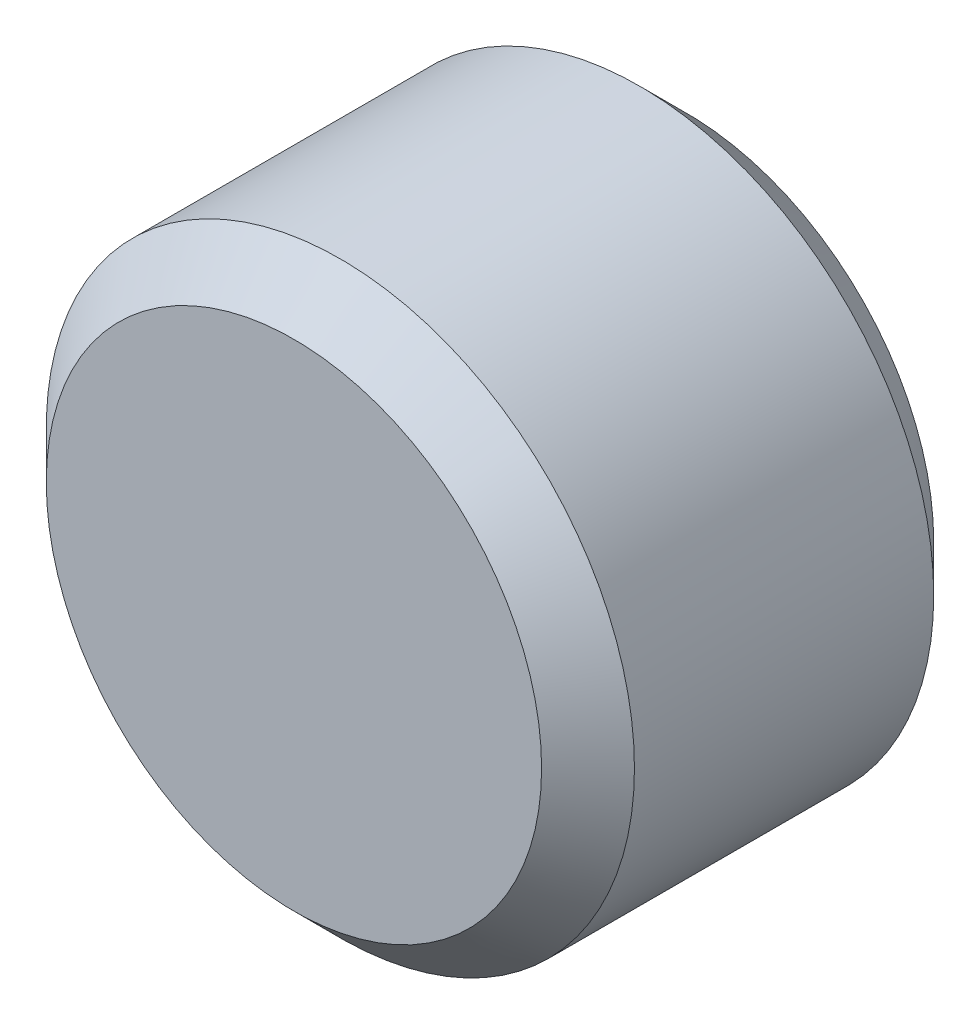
ISO-10303-21;
HEADER;
FILE_DESCRIPTION(('STEP AP214'),'2;1');
FILE_NAME('part.step','',(''),(''),'','','');
FILE_SCHEMA(('AUTOMOTIVE_DESIGN { 1 0 10303 214 1 1 1 1 }'));
ENDSEC;
DATA;
#1=APPLICATION_CONTEXT('core data for automotive mechanical design processes');
#2=APPLICATION_PROTOCOL_DEFINITION('international standard','automotive_design',2000,#1);
#3=PRODUCT_CONTEXT('',#1,'mechanical');
#4=PRODUCT('Part','Part','',(#3));
#5=PRODUCT_RELATED_PRODUCT_CATEGORY('part','',(#4));
#6=PRODUCT_DEFINITION_FORMATION('','',#4);
#7=PRODUCT_DEFINITION_CONTEXT('part definition',#1,'design');
#8=PRODUCT_DEFINITION('design','',#6,#7);
#9=PRODUCT_DEFINITION_SHAPE('','',#8);
#10=(LENGTH_UNIT() NAMED_UNIT(*) SI_UNIT(.MILLI.,.METRE.));
#11=(NAMED_UNIT(*) PLANE_ANGLE_UNIT() SI_UNIT($,.RADIAN.));
#12=(NAMED_UNIT(*) SI_UNIT($,.STERADIAN.) SOLID_ANGLE_UNIT());
#13=UNCERTAINTY_MEASURE_WITH_UNIT(LENGTH_MEASURE(1.E-05),#10,'distance_accuracy_value','');
#14=(GEOMETRIC_REPRESENTATION_CONTEXT(3) GLOBAL_UNCERTAINTY_ASSIGNED_CONTEXT((#13)) GLOBAL_UNIT_ASSIGNED_CONTEXT((#10,
#11,#12)) REPRESENTATION_CONTEXT('',''));
#15=CARTESIAN_POINT('',(0.,0.,0.));
#16=DIRECTION('',(0.,0.,1.));
#17=DIRECTION('',(1.,0.,0.));
#18=AXIS2_PLACEMENT_3D('',#15,#16,#17);
#19=CARTESIAN_POINT('',(0.,0.,8.00000000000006));
#20=DIRECTION('',(0.,0.,-1.00000000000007));
#21=DIRECTION('',(-1.00000000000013,0.,0.));
#22=AXIS2_PLACEMENT_3D('',#19,#20,#21);
#23=CYLINDRICAL_SURFACE('',#22,6.);
#24=CARTESIAN_POINT('',(-6.38378239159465E-13,2.22044604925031E-13,7.05281250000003));
#25=DIRECTION('',(0.,0.,1.00000000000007));
#26=DIRECTION('',(1.00000000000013,0.,0.));
#27=AXIS2_PLACEMENT_3D('',#24,#25,#26);
#28=CIRCLE('',#27,6.);
#29=CARTESIAN_POINT('',(6.00000000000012,2.28729278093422E-13,7.05281250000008));
#30=VERTEX_POINT('',#29);
#31=EDGE_CURVE('E50',#30,#30,#28,.F.);
#32=ORIENTED_EDGE('',*,*,#31,.T.);
#33=EDGE_LOOP('',(#32));
#34=FACE_BOUND('',#33,.T.);
#35=CARTESIAN_POINT('',(-7.49400541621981E-13,-1.11022302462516E-13,0.947187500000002));
#36=DIRECTION('',(0.,0.,1.00000000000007));
#37=DIRECTION('',(1.00000000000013,0.,0.));
#38=AXIS2_PLACEMENT_3D('',#35,#36,#37);
#39=CIRCLE('',#38,6.);
#40=CARTESIAN_POINT('',(6.00000000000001,-1.04337629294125E-13,0.947187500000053));
#41=VERTEX_POINT('',#40);
#42=EDGE_CURVE('E188',#41,#41,#39,.T.);
#43=ORIENTED_EDGE('',*,*,#42,.T.);
#44=EDGE_LOOP('',(#43));
#45=FACE_BOUND('',#44,.T.);
#46=ADVANCED_FACE('F43',(#34,#45),#23,.T.);
#47=CARTESIAN_POINT('',(0.,0.,8.00000000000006));
#48=DIRECTION('',(0.,0.,1.00000000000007));
#49=DIRECTION('',(1.00000000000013,0.,0.));
#50=AXIS2_PLACEMENT_3D('',#47,#48,#49);
#51=PLANE('',#50);
#52=CARTESIAN_POINT('',(0.,0.,8.00000000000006));
#53=DIRECTION('',(0.,0.,1.00000000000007));
#54=DIRECTION('',(1.00000000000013,0.,0.));
#55=AXIS2_PLACEMENT_3D('',#52,#53,#54);
#56=CIRCLE('',#55,5.05281249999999);
#57=CARTESIAN_POINT('',(5.05281250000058,0.,8.00000000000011));
#58=VERTEX_POINT('',#57);
#59=EDGE_CURVE('E184',#58,#58,#56,.T.);
#60=ORIENTED_EDGE('',*,*,#59,.T.);
#61=EDGE_LOOP('',(#60));
#62=FACE_BOUND('',#61,.T.);
#63=ADVANCED_FACE('F202',(#62),#51,.T.);
#64=CARTESIAN_POINT('',(0.,0.,0.));
#65=DIRECTION('',(0.,0.,1.00000000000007));
#66=DIRECTION('',(1.00000000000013,0.,0.));
#67=AXIS2_PLACEMENT_3D('',#64,#65,#66);
#68=PLANE('',#67);
#69=DIRECTION('',(-0.500000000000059,-0.866025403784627,0.));
#70=VECTOR('',#69,1.);
#71=CARTESIAN_POINT('',(1.73205080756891,-3.,0.));
#72=LINE('',#71,#70);
#73=CARTESIAN_POINT('',(3.46410161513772,0.,2.16493489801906E-12));
#74=VERTEX_POINT('',#73);
#75=CARTESIAN_POINT('',(1.73205080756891,-3.,0.));
#76=VERTEX_POINT('',#75);
#77=EDGE_CURVE('E118',#74,#76,#72,.T.);
#78=ORIENTED_EDGE('',*,*,#77,.F.);
#79=DIRECTION('',(0.500000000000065,-0.866025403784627,0.));
#80=VECTOR('',#79,1.);
#81=CARTESIAN_POINT('',(3.46410161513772,0.,2.16493489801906E-12));
#82=LINE('',#81,#80);
#83=CARTESIAN_POINT('',(1.73205080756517,2.99999999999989,0.));
#84=VERTEX_POINT('',#83);
#85=EDGE_CURVE('E57',#84,#74,#82,.T.);
#86=ORIENTED_EDGE('',*,*,#85,.F.);
#87=DIRECTION('',(1.00000000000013,0.,0.));
#88=VECTOR('',#87,1.);
#89=CARTESIAN_POINT('',(1.73205080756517,2.99999999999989,0.));
#90=LINE('',#89,#88);
#91=CARTESIAN_POINT('',(-1.7320508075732,2.99999999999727,0.));
#92=VERTEX_POINT('',#91);
#93=EDGE_CURVE('E148',#92,#84,#90,.T.);
#94=ORIENTED_EDGE('',*,*,#93,.F.);
#95=DIRECTION('',(0.500000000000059,0.866025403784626,0.));
#96=VECTOR('',#95,1.);
#97=CARTESIAN_POINT('',(-1.7320508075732,2.99999999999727,0.));
#98=LINE('',#97,#96);
#99=CARTESIAN_POINT('',(-3.46410161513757,-2.90045765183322E-12,0.));
#100=VERTEX_POINT('',#99);
#101=EDGE_CURVE('E143',#100,#92,#98,.T.);
#102=ORIENTED_EDGE('',*,*,#101,.F.);
#103=DIRECTION('',(-0.500000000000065,0.866025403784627,0.));
#104=VECTOR('',#103,1.);
#105=CARTESIAN_POINT('',(-3.46410161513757,-2.90045765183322E-12,0.));
#106=LINE('',#105,#104);
#107=CARTESIAN_POINT('',(-1.73205080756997,-3.00000000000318,0.));
#108=VERTEX_POINT('',#107);
#109=EDGE_CURVE('E141',#108,#100,#106,.T.);
#110=ORIENTED_EDGE('',*,*,#109,.F.);
#111=DIRECTION('',(-1.00000000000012,0.,0.));
#112=VECTOR('',#111,1.);
#113=CARTESIAN_POINT('',(-1.73205080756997,-3.00000000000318,0.));
#114=LINE('',#113,#112);
#115=EDGE_CURVE('E126',#76,#108,#114,.T.);
#116=ORIENTED_EDGE('',*,*,#115,.F.);
#117=EDGE_LOOP('',(#78,#86,#94,#102,#110,#116));
#118=FACE_BOUND('',#117,.T.);
#119=CARTESIAN_POINT('',(0.,0.,0.));
#120=DIRECTION('',(0.,0.,1.00000000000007));
#121=DIRECTION('',(1.00000000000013,0.,0.));
#122=AXIS2_PLACEMENT_3D('',#119,#120,#121);
#123=CIRCLE('',#122,5.05281249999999);
#124=CARTESIAN_POINT('',(5.05281250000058,0.,0.));
#125=VERTEX_POINT('',#124);
#126=EDGE_CURVE('E13',#125,#125,#123,.F.);
#127=ORIENTED_EDGE('',*,*,#126,.T.);
#128=EDGE_LOOP('',(#127));
#129=FACE_BOUND('',#128,.T.);
#130=ADVANCED_FACE('F138',(#118,#129),#68,.F.);
#131=CARTESIAN_POINT('',(0.,0.,8.00000000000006));
#132=DIRECTION('',(0.,0.,-1.00000000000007));
#133=DIRECTION('',(-1.00000000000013,0.,0.));
#134=AXIS2_PLACEMENT_3D('',#131,#132,#133);
#135=CONICAL_SURFACE('',#134,5.05281249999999,0.785398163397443);
#136=ORIENTED_EDGE('',*,*,#31,.F.);
#137=EDGE_LOOP('',(#136));
#138=FACE_BOUND('',#137,.T.);
#139=ORIENTED_EDGE('',*,*,#59,.F.);
#140=EDGE_LOOP('',(#139));
#141=FACE_BOUND('',#140,.T.);
#142=ADVANCED_FACE('F195',(#138,#141),#135,.T.);
#143=CARTESIAN_POINT('',(-7.49400541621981E-13,-1.11022302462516E-13,0.947187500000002));
#144=DIRECTION('',(0.,0.,1.00000000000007));
#145=DIRECTION('',(1.00000000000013,0.,0.));
#146=AXIS2_PLACEMENT_3D('',#143,#144,#145);
#147=CONICAL_SURFACE('',#146,6.,0.785398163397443);
#148=ORIENTED_EDGE('',*,*,#126,.F.);
#149=EDGE_LOOP('',(#148));
#150=FACE_BOUND('',#149,.T.);
#151=ORIENTED_EDGE('',*,*,#42,.F.);
#152=EDGE_LOOP('',(#151));
#153=FACE_BOUND('',#152,.T.);
#154=ADVANCED_FACE('F198',(#150,#153),#147,.T.);
#155=CARTESIAN_POINT('',(3.4641016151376,0.,4.80000000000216));
#156=DIRECTION('',(0.866025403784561,0.500000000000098,0.));
#157=DIRECTION('',(-0.500000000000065,0.866025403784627,0.));
#158=AXIS2_PLACEMENT_3D('',#155,#156,#157);
#159=PLANE('',#158);
#160=ORIENTED_EDGE('',*,*,#85,.T.);
#161=DIRECTION('',(0.,0.,-1.00000000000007));
#162=VECTOR('',#161,1.);
#163=CARTESIAN_POINT('',(3.4641016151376,0.,4.80000000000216));
#164=LINE('',#163,#162);
#165=CARTESIAN_POINT('',(3.4641016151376,0.,4.80000000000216));
#166=VERTEX_POINT('',#165);
#167=EDGE_CURVE('E123',#166,#74,#164,.T.);
#168=ORIENTED_EDGE('',*,*,#167,.F.);
#169=DIRECTION('',(0.500000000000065,-0.866025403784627,0.));
#170=VECTOR('',#169,1.);
#171=CARTESIAN_POINT('',(3.4641016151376,0.,4.80000000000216));
#172=LINE('',#171,#170);
#173=CARTESIAN_POINT('',(2.59807621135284,1.50000000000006,4.8));
#174=VERTEX_POINT('',#173);
#175=EDGE_CURVE('E150',#174,#166,#172,.T.);
#176=ORIENTED_EDGE('',*,*,#175,.F.);
#177=CARTESIAN_POINT('',(1.73205080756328,3.00000000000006,4.8));
#178=VERTEX_POINT('',#177);
#179=EDGE_CURVE('E151',#178,#174,#172,.T.);
#180=ORIENTED_EDGE('',*,*,#179,.F.);
#181=DIRECTION('',(0.,0.,-1.00000000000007));
#182=VECTOR('',#181,1.);
#183=CARTESIAN_POINT('',(1.73205080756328,3.00000000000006,4.8));
#184=LINE('',#183,#182);
#185=EDGE_CURVE('E170',#178,#84,#184,.T.);
#186=ORIENTED_EDGE('',*,*,#185,.T.);
#187=EDGE_LOOP('',(#160,#168,#176,#180,#186));
#188=FACE_BOUND('',#187,.T.);
#189=ADVANCED_FACE('F212',(#188),#159,.F.);
#190=CARTESIAN_POINT('',(1.73205080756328,3.00000000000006,4.8));
#191=DIRECTION('',(0.,1.00000000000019,0.));
#192=DIRECTION('',(0.,0.,1.00000000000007));
#193=AXIS2_PLACEMENT_3D('',#190,#191,#192);
#194=PLANE('',#193);
#195=ORIENTED_EDGE('',*,*,#93,.T.);
#196=ORIENTED_EDGE('',*,*,#185,.F.);
#197=DIRECTION('',(1.00000000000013,0.,0.));
#198=VECTOR('',#197,1.);
#199=CARTESIAN_POINT('',(1.73205080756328,3.00000000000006,4.8));
#200=LINE('',#199,#198);
#201=CARTESIAN_POINT('',(-5.82867087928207E-12,3.00000000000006,4.8));
#202=VERTEX_POINT('',#201);
#203=EDGE_CURVE('E166',#202,#178,#200,.T.);
#204=ORIENTED_EDGE('',*,*,#203,.F.);
#205=CARTESIAN_POINT('',(-1.73205080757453,2.99999999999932,4.8));
#206=VERTEX_POINT('',#205);
#207=EDGE_CURVE('E167',#206,#202,#200,.T.);
#208=ORIENTED_EDGE('',*,*,#207,.F.);
#209=DIRECTION('',(0.,0.,-1.00000000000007));
#210=VECTOR('',#209,1.);
#211=CARTESIAN_POINT('',(-1.73205080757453,2.99999999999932,4.8));
#212=LINE('',#211,#210);
#213=EDGE_CURVE('E173',#206,#92,#212,.T.);
#214=ORIENTED_EDGE('',*,*,#213,.T.);
#215=EDGE_LOOP('',(#195,#196,#204,#208,#214));
#216=FACE_BOUND('',#215,.T.);
#217=ADVANCED_FACE('F221',(#216),#194,.F.);
#218=CARTESIAN_POINT('',(-1.73205080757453,2.99999999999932,4.8));
#219=DIRECTION('',(-0.866025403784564,0.500000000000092,0.));
#220=DIRECTION('',(-0.50000000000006,-0.866025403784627,0.));
#221=AXIS2_PLACEMENT_3D('',#218,#219,#220);
#222=PLANE('',#221);
#223=ORIENTED_EDGE('',*,*,#101,.T.);
#224=ORIENTED_EDGE('',*,*,#213,.F.);
#225=DIRECTION('',(0.500000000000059,0.866025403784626,0.));
#226=VECTOR('',#225,1.);
#227=CARTESIAN_POINT('',(-1.73205080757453,2.99999999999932,4.8));
#228=LINE('',#227,#226);
#229=CARTESIAN_POINT('',(-2.59807621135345,1.49999999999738,4.80000000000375));
#230=VERTEX_POINT('',#229);
#231=EDGE_CURVE('E162',#230,#206,#228,.T.);
#232=ORIENTED_EDGE('',*,*,#231,.F.);
#233=CARTESIAN_POINT('',(-3.46410161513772,-2.4008572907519E-12,4.79999999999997));
#234=VERTEX_POINT('',#233);
#235=EDGE_CURVE('E163',#234,#230,#228,.T.);
#236=ORIENTED_EDGE('',*,*,#235,.F.);
#237=DIRECTION('',(0.,0.,-1.00000000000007));
#238=VECTOR('',#237,1.);
#239=CARTESIAN_POINT('',(-3.46410161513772,-2.4008572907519E-12,4.79999999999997));
#240=LINE('',#239,#238);
#241=EDGE_CURVE('E176',#234,#100,#240,.T.);
#242=ORIENTED_EDGE('',*,*,#241,.T.);
#243=EDGE_LOOP('',(#223,#224,#232,#236,#242));
#244=FACE_BOUND('',#243,.T.);
#245=ADVANCED_FACE('F230',(#244),#222,.F.);
#246=CARTESIAN_POINT('',(-3.46410161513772,-2.4008572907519E-12,4.79999999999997));
#247=DIRECTION('',(-0.866025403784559,-0.500000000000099,0.));
#248=DIRECTION('',(0.500000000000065,-0.866025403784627,0.));
#249=AXIS2_PLACEMENT_3D('',#246,#247,#248);
#250=PLANE('',#249);
#251=ORIENTED_EDGE('',*,*,#109,.T.);
#252=ORIENTED_EDGE('',*,*,#241,.F.);
#253=DIRECTION('',(-0.500000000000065,0.866025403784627,0.));
#254=VECTOR('',#253,1.);
#255=CARTESIAN_POINT('',(-3.46410161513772,-2.4008572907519E-12,4.79999999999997));
#256=LINE('',#255,#254);
#257=CARTESIAN_POINT('',(-2.59807621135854,-1.5000000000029,4.80000000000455));
#258=VERTEX_POINT('',#257);
#259=EDGE_CURVE('E158',#258,#234,#256,.T.);
#260=ORIENTED_EDGE('',*,*,#259,.F.);
#261=CARTESIAN_POINT('',(-1.73205080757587,-3.00000000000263,4.80000000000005));
#262=VERTEX_POINT('',#261);
#263=EDGE_CURVE('E159',#262,#258,#256,.T.);
#264=ORIENTED_EDGE('',*,*,#263,.F.);
#265=DIRECTION('',(0.,0.,-1.00000000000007));
#266=VECTOR('',#265,1.);
#267=CARTESIAN_POINT('',(-1.73205080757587,-3.00000000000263,4.80000000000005));
#268=LINE('',#267,#266);
#269=EDGE_CURVE('E135',#262,#108,#268,.T.);
#270=ORIENTED_EDGE('',*,*,#269,.T.);
#271=EDGE_LOOP('',(#251,#252,#260,#264,#270));
#272=FACE_BOUND('',#271,.T.);
#273=ADVANCED_FACE('F227',(#272),#250,.F.);
#274=CARTESIAN_POINT('',(-1.73205080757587,-3.00000000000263,4.80000000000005));
#275=DIRECTION('',(0.,-1.00000000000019,0.));
#276=DIRECTION('',(1.00000000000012,0.,0.));
#277=AXIS2_PLACEMENT_3D('',#274,#275,#276);
#278=PLANE('',#277);
#279=ORIENTED_EDGE('',*,*,#115,.T.);
#280=ORIENTED_EDGE('',*,*,#269,.F.);
#281=DIRECTION('',(-1.00000000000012,0.,0.));
#282=VECTOR('',#281,1.);
#283=CARTESIAN_POINT('',(-1.73205080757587,-3.00000000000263,4.80000000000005));
#284=LINE('',#283,#282);
#285=CARTESIAN_POINT('',(-5.69683189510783E-12,-3.,4.80000000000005));
#286=VERTEX_POINT('',#285);
#287=EDGE_CURVE('E156',#286,#262,#284,.T.);
#288=ORIENTED_EDGE('',*,*,#287,.F.);
#289=CARTESIAN_POINT('',(1.73205080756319,-3.00000000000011,4.80000000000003));
#290=VERTEX_POINT('',#289);
#291=EDGE_CURVE('E134',#290,#286,#284,.T.);
#292=ORIENTED_EDGE('',*,*,#291,.F.);
#293=DIRECTION('',(0.,0.,-1.00000000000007));
#294=VECTOR('',#293,1.);
#295=CARTESIAN_POINT('',(1.73205080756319,-3.00000000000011,4.80000000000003));
#296=LINE('',#295,#294);
#297=EDGE_CURVE('E121',#290,#76,#296,.T.);
#298=ORIENTED_EDGE('',*,*,#297,.T.);
#299=EDGE_LOOP('',(#279,#280,#288,#292,#298));
#300=FACE_BOUND('',#299,.T.);
#301=ADVANCED_FACE('F129',(#300),#278,.F.);
#302=CARTESIAN_POINT('',(1.73205080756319,-3.00000000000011,4.80000000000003));
#303=DIRECTION('',(0.866025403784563,-0.500000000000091,0.));
#304=DIRECTION('',(0.500000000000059,0.866025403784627,0.));
#305=AXIS2_PLACEMENT_3D('',#302,#303,#304);
#306=PLANE('',#305);
#307=ORIENTED_EDGE('',*,*,#77,.T.);
#308=ORIENTED_EDGE('',*,*,#297,.F.);
#309=DIRECTION('',(-0.500000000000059,-0.866025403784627,0.));
#310=VECTOR('',#309,1.);
#311=CARTESIAN_POINT('',(1.73205080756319,-3.00000000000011,4.80000000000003));
#312=LINE('',#311,#310);
#313=CARTESIAN_POINT('',(2.59807621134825,-1.5,4.80000000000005));
#314=VERTEX_POINT('',#313);
#315=EDGE_CURVE('E154',#314,#290,#312,.T.);
#316=ORIENTED_EDGE('',*,*,#315,.F.);
#317=EDGE_CURVE('E65',#166,#314,#312,.T.);
#318=ORIENTED_EDGE('',*,*,#317,.F.);
#319=ORIENTED_EDGE('',*,*,#167,.T.);
#320=EDGE_LOOP('',(#307,#308,#316,#318,#319));
#321=FACE_BOUND('',#320,.T.);
#322=ADVANCED_FACE('F120',(#321),#306,.F.);
#323=CARTESIAN_POINT('',(1.73205080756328,3.00000000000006,4.8));
#324=DIRECTION('',(0.,0.,1.00000000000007));
#325=DIRECTION('',(1.00000000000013,0.,0.));
#326=AXIS2_PLACEMENT_3D('',#323,#324,#325);
#327=PLANE('',#326);
#328=ORIENTED_EDGE('',*,*,#315,.T.);
#329=ORIENTED_EDGE('',*,*,#291,.T.);
#330=CARTESIAN_POINT('',(0.,0.,4.80000000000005));
#331=DIRECTION('',(0.,0.,-1.00000000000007));
#332=DIRECTION('',(-1.00000000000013,0.,0.));
#333=AXIS2_PLACEMENT_3D('',#330,#331,#332);
#334=CIRCLE('',#333,3.);
#335=EDGE_CURVE('E259',#314,#286,#334,.T.);
#336=ORIENTED_EDGE('',*,*,#335,.F.);
#337=EDGE_LOOP('',(#328,#329,#336));
#338=FACE_BOUND('',#337,.T.);
#339=ADVANCED_FACE('F224',(#338),#327,.F.);
#340=ORIENTED_EDGE('',*,*,#287,.T.);
#341=ORIENTED_EDGE('',*,*,#263,.T.);
#342=EDGE_CURVE('E262',#286,#258,#334,.T.);
#343=ORIENTED_EDGE('',*,*,#342,.F.);
#344=EDGE_LOOP('',(#340,#341,#343));
#345=FACE_BOUND('',#344,.T.);
#346=ADVANCED_FACE('F239',(#345),#327,.F.);
#347=ORIENTED_EDGE('',*,*,#259,.T.);
#348=ORIENTED_EDGE('',*,*,#235,.T.);
#349=EDGE_CURVE('E172',#258,#230,#334,.T.);
#350=ORIENTED_EDGE('',*,*,#349,.F.);
#351=EDGE_LOOP('',(#347,#348,#350));
#352=FACE_BOUND('',#351,.T.);
#353=ADVANCED_FACE('F244',(#352),#327,.F.);
#354=ORIENTED_EDGE('',*,*,#231,.T.);
#355=ORIENTED_EDGE('',*,*,#207,.T.);
#356=EDGE_CURVE('E181',#230,#202,#334,.T.);
#357=ORIENTED_EDGE('',*,*,#356,.F.);
#358=EDGE_LOOP('',(#354,#355,#357));
#359=FACE_BOUND('',#358,.T.);
#360=ADVANCED_FACE('F251',(#359),#327,.F.);
#361=ORIENTED_EDGE('',*,*,#203,.T.);
#362=ORIENTED_EDGE('',*,*,#179,.T.);
#363=EDGE_CURVE('E185',#202,#174,#334,.T.);
#364=ORIENTED_EDGE('',*,*,#363,.F.);
#365=EDGE_LOOP('',(#361,#362,#364));
#366=FACE_BOUND('',#365,.T.);
#367=ADVANCED_FACE('F247',(#366),#327,.F.);
#368=ORIENTED_EDGE('',*,*,#175,.T.);
#369=ORIENTED_EDGE('',*,*,#317,.T.);
#370=EDGE_CURVE('E255',#174,#314,#334,.T.);
#371=ORIENTED_EDGE('',*,*,#370,.F.);
#372=EDGE_LOOP('',(#368,#369,#371));
#373=FACE_BOUND('',#372,.T.);
#374=ADVANCED_FACE('F217',(#373),#327,.F.);
#375=CARTESIAN_POINT('',(0.,0.,4.80000000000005));
#376=DIRECTION('',(0.,0.,-1.00000000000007));
#377=DIRECTION('',(-1.00000000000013,0.,0.));
#378=AXIS2_PLACEMENT_3D('',#375,#376,#377);
#379=CONICAL_SURFACE('',#378,3.,1.0471975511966);
#380=CARTESIAN_POINT('',(0.,1.66533453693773E-13,6.53205080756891));
#381=VERTEX_POINT('',#380);
#382=VERTEX_LOOP('',#381);
#383=FACE_BOUND('',#382,.T.);
#384=ORIENTED_EDGE('',*,*,#356,.T.);
#385=ORIENTED_EDGE('',*,*,#363,.T.);
#386=ORIENTED_EDGE('',*,*,#370,.T.);
#387=ORIENTED_EDGE('',*,*,#335,.T.);
#388=ORIENTED_EDGE('',*,*,#342,.T.);
#389=ORIENTED_EDGE('',*,*,#349,.T.);
#390=EDGE_LOOP('',(#384,#385,#386,#387,#388,#389));
#391=FACE_BOUND('',#390,.T.);
#392=ADVANCED_FACE('F214',(#383,#391),#379,.F.);
#393=CLOSED_SHELL('',(#46,#63,#130,#142,#154,#189,#217,#245,#273,#301,#322,#339,#346,#353,#360,
#367,#374,#392));
#394=MANIFOLD_SOLID_BREP('B2',#393);
#395=ADVANCED_BREP_SHAPE_REPRESENTATION('',(#18,#394),#14);
#396=SHAPE_DEFINITION_REPRESENTATION(#9,#395);
ENDSEC;
END-ISO-10303-21;
